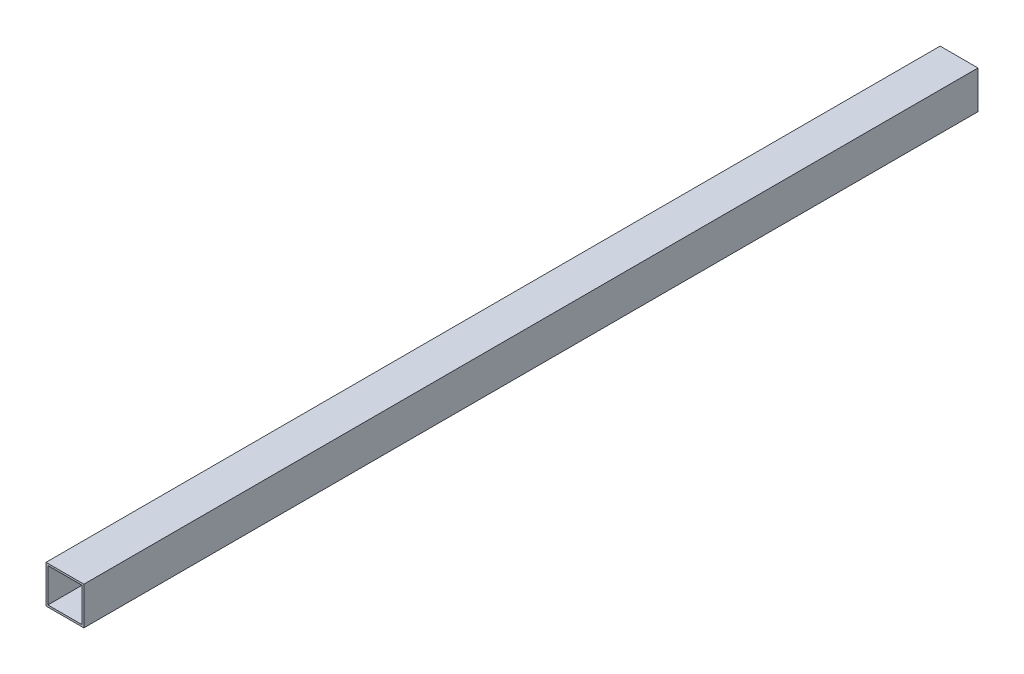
ISO-10303-21;
HEADER;
FILE_DESCRIPTION(('STEP AP214'),'2;1');
FILE_NAME('part.step','',(''),(''),'','','');
FILE_SCHEMA(('AUTOMOTIVE_DESIGN { 1 0 10303 214 1 1 1 1 }'));
ENDSEC;
DATA;
#1=APPLICATION_CONTEXT('core data for automotive mechanical design processes');
#2=APPLICATION_PROTOCOL_DEFINITION('international standard','automotive_design',2000,#1);
#3=PRODUCT_CONTEXT('',#1,'mechanical');
#4=PRODUCT('Part','Part','',(#3));
#5=PRODUCT_RELATED_PRODUCT_CATEGORY('part','',(#4));
#6=PRODUCT_DEFINITION_FORMATION('','',#4);
#7=PRODUCT_DEFINITION_CONTEXT('part definition',#1,'design');
#8=PRODUCT_DEFINITION('design','',#6,#7);
#9=PRODUCT_DEFINITION_SHAPE('','',#8);
#10=(LENGTH_UNIT() NAMED_UNIT(*) SI_UNIT(.MILLI.,.METRE.));
#11=(NAMED_UNIT(*) PLANE_ANGLE_UNIT() SI_UNIT($,.RADIAN.));
#12=(NAMED_UNIT(*) SI_UNIT($,.STERADIAN.) SOLID_ANGLE_UNIT());
#13=UNCERTAINTY_MEASURE_WITH_UNIT(LENGTH_MEASURE(1.E-05),#10,'distance_accuracy_value','');
#14=(GEOMETRIC_REPRESENTATION_CONTEXT(3) GLOBAL_UNCERTAINTY_ASSIGNED_CONTEXT((#13)) GLOBAL_UNIT_ASSIGNED_CONTEXT((#10,
#11,#12)) REPRESENTATION_CONTEXT('',''));
#15=CARTESIAN_POINT('',(0.,0.,0.));
#16=DIRECTION('',(0.,0.,1.));
#17=DIRECTION('',(1.,0.,0.));
#18=AXIS2_PLACEMENT_3D('',#15,#16,#17);
#19=CARTESIAN_POINT('',(0.,0.,1888.));
#20=DIRECTION('',(0.,0.,1.));
#21=DIRECTION('',(1.,0.,0.));
#22=AXIS2_PLACEMENT_3D('',#19,#20,#21);
#23=PLANE('',#22);
#24=DIRECTION('',(0.,-1.,0.));
#25=VECTOR('',#24,1.);
#26=CARTESIAN_POINT('',(-36.,36.,1888.));
#27=LINE('',#26,#25);
#28=CARTESIAN_POINT('',(-36.,36.,1888.));
#29=VERTEX_POINT('',#28);
#30=CARTESIAN_POINT('',(-36.,-36.,1888.));
#31=VERTEX_POINT('',#30);
#32=EDGE_CURVE('E26',#29,#31,#27,.T.);
#33=ORIENTED_EDGE('',*,*,#32,.F.);
#34=DIRECTION('',(-1.,0.,0.));
#35=VECTOR('',#34,1.);
#36=CARTESIAN_POINT('',(36.,36.,1888.));
#37=LINE('',#36,#35);
#38=CARTESIAN_POINT('',(36.,36.,1888.));
#39=VERTEX_POINT('',#38);
#40=EDGE_CURVE('E106',#39,#29,#37,.T.);
#41=ORIENTED_EDGE('',*,*,#40,.F.);
#42=DIRECTION('',(0.,1.,0.));
#43=VECTOR('',#42,1.);
#44=CARTESIAN_POINT('',(36.,-36.,1888.));
#45=LINE('',#44,#43);
#46=CARTESIAN_POINT('',(36.,-36.,1888.));
#47=VERTEX_POINT('',#46);
#48=EDGE_CURVE('E109',#47,#39,#45,.T.);
#49=ORIENTED_EDGE('',*,*,#48,.F.);
#50=DIRECTION('',(1.,0.,0.));
#51=VECTOR('',#50,1.);
#52=CARTESIAN_POINT('',(-36.,-36.,1888.));
#53=LINE('',#52,#51);
#54=EDGE_CURVE('E128',#31,#47,#53,.T.);
#55=ORIENTED_EDGE('',*,*,#54,.F.);
#56=EDGE_LOOP('',(#33,#41,#49,#55));
#57=FACE_BOUND('',#56,.T.);
#58=DIRECTION('',(1.,0.,0.));
#59=VECTOR('',#58,1.);
#60=CARTESIAN_POINT('',(-40.,-40.,1888.));
#61=LINE('',#60,#59);
#62=CARTESIAN_POINT('',(-40.,-40.,1888.));
#63=VERTEX_POINT('',#62);
#64=CARTESIAN_POINT('',(40.,-40.,1888.));
#65=VERTEX_POINT('',#64);
#66=EDGE_CURVE('E187',#63,#65,#61,.T.);
#67=ORIENTED_EDGE('',*,*,#66,.T.);
#68=DIRECTION('',(0.,1.,0.));
#69=VECTOR('',#68,1.);
#70=CARTESIAN_POINT('',(40.,-40.,1888.));
#71=LINE('',#70,#69);
#72=CARTESIAN_POINT('',(40.,40.,1888.));
#73=VERTEX_POINT('',#72);
#74=EDGE_CURVE('E209',#65,#73,#71,.T.);
#75=ORIENTED_EDGE('',*,*,#74,.T.);
#76=DIRECTION('',(-1.,0.,0.));
#77=VECTOR('',#76,1.);
#78=CARTESIAN_POINT('',(40.,40.,1888.));
#79=LINE('',#78,#77);
#80=CARTESIAN_POINT('',(-40.,40.,1888.));
#81=VERTEX_POINT('',#80);
#82=EDGE_CURVE('E179',#73,#81,#79,.T.);
#83=ORIENTED_EDGE('',*,*,#82,.T.);
#84=DIRECTION('',(0.,-1.,0.));
#85=VECTOR('',#84,1.);
#86=CARTESIAN_POINT('',(-40.,40.,1888.));
#87=LINE('',#86,#85);
#88=EDGE_CURVE('E136',#81,#63,#87,.T.);
#89=ORIENTED_EDGE('',*,*,#88,.T.);
#90=EDGE_LOOP('',(#67,#75,#83,#89));
#91=FACE_BOUND('',#90,.T.);
#92=ADVANCED_FACE('F16',(#57,#91),#23,.T.);
#93=CARTESIAN_POINT('',(0.,0.,0.));
#94=DIRECTION('',(0.,0.,1.));
#95=DIRECTION('',(1.,0.,0.));
#96=AXIS2_PLACEMENT_3D('',#93,#94,#95);
#97=PLANE('',#96);
#98=DIRECTION('',(1.,0.,0.));
#99=VECTOR('',#98,1.);
#100=CARTESIAN_POINT('',(-36.,-36.,0.));
#101=LINE('',#100,#99);
#102=CARTESIAN_POINT('',(-36.,-36.,0.));
#103=VERTEX_POINT('',#102);
#104=CARTESIAN_POINT('',(36.,-36.,0.));
#105=VERTEX_POINT('',#104);
#106=EDGE_CURVE('E101',#103,#105,#101,.T.);
#107=ORIENTED_EDGE('',*,*,#106,.T.);
#108=DIRECTION('',(0.,1.,0.));
#109=VECTOR('',#108,1.);
#110=CARTESIAN_POINT('',(36.,-36.,0.));
#111=LINE('',#110,#109);
#112=CARTESIAN_POINT('',(36.,36.,0.));
#113=VERTEX_POINT('',#112);
#114=EDGE_CURVE('E98',#105,#113,#111,.T.);
#115=ORIENTED_EDGE('',*,*,#114,.T.);
#116=DIRECTION('',(-1.,0.,0.));
#117=VECTOR('',#116,1.);
#118=CARTESIAN_POINT('',(36.,36.,0.));
#119=LINE('',#118,#117);
#120=CARTESIAN_POINT('',(-36.,36.,0.));
#121=VERTEX_POINT('',#120);
#122=EDGE_CURVE('E85',#113,#121,#119,.T.);
#123=ORIENTED_EDGE('',*,*,#122,.T.);
#124=DIRECTION('',(0.,-1.,0.));
#125=VECTOR('',#124,1.);
#126=CARTESIAN_POINT('',(-36.,36.,0.));
#127=LINE('',#126,#125);
#128=EDGE_CURVE('E10',#121,#103,#127,.T.);
#129=ORIENTED_EDGE('',*,*,#128,.T.);
#130=EDGE_LOOP('',(#107,#115,#123,#129));
#131=FACE_BOUND('',#130,.T.);
#132=DIRECTION('',(0.,-1.,0.));
#133=VECTOR('',#132,1.);
#134=CARTESIAN_POINT('',(-40.,40.,0.));
#135=LINE('',#134,#133);
#136=CARTESIAN_POINT('',(-40.,40.,0.));
#137=VERTEX_POINT('',#136);
#138=CARTESIAN_POINT('',(-40.,-40.,0.));
#139=VERTEX_POINT('',#138);
#140=EDGE_CURVE('E141',#137,#139,#135,.T.);
#141=ORIENTED_EDGE('',*,*,#140,.F.);
#142=DIRECTION('',(-1.,0.,0.));
#143=VECTOR('',#142,1.);
#144=CARTESIAN_POINT('',(40.,40.,0.));
#145=LINE('',#144,#143);
#146=CARTESIAN_POINT('',(40.,40.,0.));
#147=VERTEX_POINT('',#146);
#148=EDGE_CURVE('E198',#147,#137,#145,.T.);
#149=ORIENTED_EDGE('',*,*,#148,.F.);
#150=DIRECTION('',(0.,1.,0.));
#151=VECTOR('',#150,1.);
#152=CARTESIAN_POINT('',(40.,-40.,0.));
#153=LINE('',#152,#151);
#154=CARTESIAN_POINT('',(40.,-40.,0.));
#155=VERTEX_POINT('',#154);
#156=EDGE_CURVE('E162',#155,#147,#153,.T.);
#157=ORIENTED_EDGE('',*,*,#156,.F.);
#158=DIRECTION('',(1.,0.,0.));
#159=VECTOR('',#158,1.);
#160=CARTESIAN_POINT('',(-40.,-40.,0.));
#161=LINE('',#160,#159);
#162=EDGE_CURVE('E185',#139,#155,#161,.T.);
#163=ORIENTED_EDGE('',*,*,#162,.F.);
#164=EDGE_LOOP('',(#141,#149,#157,#163));
#165=FACE_BOUND('',#164,.T.);
#166=ADVANCED_FACE('F18',(#131,#165),#97,.F.);
#167=CARTESIAN_POINT('',(-36.,36.,0.));
#168=DIRECTION('',(1.,0.,0.));
#169=DIRECTION('',(0.,1.,0.));
#170=AXIS2_PLACEMENT_3D('',#167,#168,#169);
#171=PLANE('',#170);
#172=DIRECTION('',(0.,0.,1.));
#173=VECTOR('',#172,1.);
#174=CARTESIAN_POINT('',(-36.,36.,0.));
#175=LINE('',#174,#173);
#176=EDGE_CURVE('E92',#121,#29,#175,.T.);
#177=ORIENTED_EDGE('',*,*,#176,.T.);
#178=ORIENTED_EDGE('',*,*,#32,.T.);
#179=DIRECTION('',(0.,0.,1.));
#180=VECTOR('',#179,1.);
#181=CARTESIAN_POINT('',(-36.,-36.,0.));
#182=LINE('',#181,#180);
#183=EDGE_CURVE('E125',#103,#31,#182,.T.);
#184=ORIENTED_EDGE('',*,*,#183,.F.);
#185=ORIENTED_EDGE('',*,*,#128,.F.);
#186=EDGE_LOOP('',(#177,#178,#184,#185));
#187=FACE_BOUND('',#186,.T.);
#188=ADVANCED_FACE('F123',(#187),#171,.T.);
#189=CARTESIAN_POINT('',(36.,36.,0.));
#190=DIRECTION('',(0.,-1.,0.));
#191=DIRECTION('',(0.,0.,-1.));
#192=AXIS2_PLACEMENT_3D('',#189,#190,#191);
#193=PLANE('',#192);
#194=DIRECTION('',(0.,0.,1.));
#195=VECTOR('',#194,1.);
#196=CARTESIAN_POINT('',(36.,36.,0.));
#197=LINE('',#196,#195);
#198=EDGE_CURVE('E90',#113,#39,#197,.T.);
#199=ORIENTED_EDGE('',*,*,#198,.T.);
#200=ORIENTED_EDGE('',*,*,#40,.T.);
#201=ORIENTED_EDGE('',*,*,#176,.F.);
#202=ORIENTED_EDGE('',*,*,#122,.F.);
#203=EDGE_LOOP('',(#199,#200,#201,#202));
#204=FACE_BOUND('',#203,.T.);
#205=ADVANCED_FACE('F87',(#204),#193,.T.);
#206=CARTESIAN_POINT('',(36.,-36.,0.));
#207=DIRECTION('',(-1.,0.,0.));
#208=DIRECTION('',(0.,0.,1.));
#209=AXIS2_PLACEMENT_3D('',#206,#207,#208);
#210=PLANE('',#209);
#211=DIRECTION('',(0.,0.,1.));
#212=VECTOR('',#211,1.);
#213=CARTESIAN_POINT('',(36.,-36.,0.));
#214=LINE('',#213,#212);
#215=EDGE_CURVE('E132',#105,#47,#214,.T.);
#216=ORIENTED_EDGE('',*,*,#215,.T.);
#217=ORIENTED_EDGE('',*,*,#48,.T.);
#218=ORIENTED_EDGE('',*,*,#198,.F.);
#219=ORIENTED_EDGE('',*,*,#114,.F.);
#220=EDGE_LOOP('',(#216,#217,#218,#219));
#221=FACE_BOUND('',#220,.T.);
#222=ADVANCED_FACE('F108',(#221),#210,.T.);
#223=CARTESIAN_POINT('',(-36.,-36.,0.));
#224=DIRECTION('',(0.,1.,0.));
#225=DIRECTION('',(1.,0.,0.));
#226=AXIS2_PLACEMENT_3D('',#223,#224,#225);
#227=PLANE('',#226);
#228=ORIENTED_EDGE('',*,*,#183,.T.);
#229=ORIENTED_EDGE('',*,*,#54,.T.);
#230=ORIENTED_EDGE('',*,*,#215,.F.);
#231=ORIENTED_EDGE('',*,*,#106,.F.);
#232=EDGE_LOOP('',(#228,#229,#230,#231));
#233=FACE_BOUND('',#232,.T.);
#234=ADVANCED_FACE('F134',(#233),#227,.T.);
#235=CARTESIAN_POINT('',(-40.,40.,0.));
#236=DIRECTION('',(1.,0.,0.));
#237=DIRECTION('',(0.,1.,0.));
#238=AXIS2_PLACEMENT_3D('',#235,#236,#237);
#239=PLANE('',#238);
#240=ORIENTED_EDGE('',*,*,#140,.T.);
#241=DIRECTION('',(0.,0.,1.));
#242=VECTOR('',#241,1.);
#243=CARTESIAN_POINT('',(-40.,-40.,0.));
#244=LINE('',#243,#242);
#245=EDGE_CURVE('E173',#139,#63,#244,.T.);
#246=ORIENTED_EDGE('',*,*,#245,.T.);
#247=ORIENTED_EDGE('',*,*,#88,.F.);
#248=DIRECTION('',(0.,0.,1.));
#249=VECTOR('',#248,1.);
#250=CARTESIAN_POINT('',(-40.,40.,0.));
#251=LINE('',#250,#249);
#252=EDGE_CURVE('E176',#137,#81,#251,.T.);
#253=ORIENTED_EDGE('',*,*,#252,.F.);
#254=EDGE_LOOP('',(#240,#246,#247,#253));
#255=FACE_BOUND('',#254,.T.);
#256=ADVANCED_FACE('F172',(#255),#239,.F.);
#257=CARTESIAN_POINT('',(40.,40.,0.));
#258=DIRECTION('',(0.,-1.,0.));
#259=DIRECTION('',(0.,0.,-1.));
#260=AXIS2_PLACEMENT_3D('',#257,#258,#259);
#261=PLANE('',#260);
#262=ORIENTED_EDGE('',*,*,#148,.T.);
#263=ORIENTED_EDGE('',*,*,#252,.T.);
#264=ORIENTED_EDGE('',*,*,#82,.F.);
#265=DIRECTION('',(0.,0.,1.));
#266=VECTOR('',#265,1.);
#267=CARTESIAN_POINT('',(40.,40.,0.));
#268=LINE('',#267,#266);
#269=EDGE_CURVE('E205',#147,#73,#268,.T.);
#270=ORIENTED_EDGE('',*,*,#269,.F.);
#271=EDGE_LOOP('',(#262,#263,#264,#270));
#272=FACE_BOUND('',#271,.T.);
#273=ADVANCED_FACE('F219',(#272),#261,.F.);
#274=CARTESIAN_POINT('',(40.,-40.,0.));
#275=DIRECTION('',(-1.,0.,0.));
#276=DIRECTION('',(0.,0.,1.));
#277=AXIS2_PLACEMENT_3D('',#274,#275,#276);
#278=PLANE('',#277);
#279=ORIENTED_EDGE('',*,*,#156,.T.);
#280=ORIENTED_EDGE('',*,*,#269,.T.);
#281=ORIENTED_EDGE('',*,*,#74,.F.);
#282=DIRECTION('',(0.,0.,1.));
#283=VECTOR('',#282,1.);
#284=CARTESIAN_POINT('',(40.,-40.,0.));
#285=LINE('',#284,#283);
#286=EDGE_CURVE('E191',#155,#65,#285,.T.);
#287=ORIENTED_EDGE('',*,*,#286,.F.);
#288=EDGE_LOOP('',(#279,#280,#281,#287));
#289=FACE_BOUND('',#288,.T.);
#290=ADVANCED_FACE('F221',(#289),#278,.F.);
#291=CARTESIAN_POINT('',(-40.,-40.,0.));
#292=DIRECTION('',(0.,1.,0.));
#293=DIRECTION('',(1.,0.,0.));
#294=AXIS2_PLACEMENT_3D('',#291,#292,#293);
#295=PLANE('',#294);
#296=ORIENTED_EDGE('',*,*,#162,.T.);
#297=ORIENTED_EDGE('',*,*,#286,.T.);
#298=ORIENTED_EDGE('',*,*,#66,.F.);
#299=ORIENTED_EDGE('',*,*,#245,.F.);
#300=EDGE_LOOP('',(#296,#297,#298,#299));
#301=FACE_BOUND('',#300,.T.);
#302=ADVANCED_FACE('F183',(#301),#295,.F.);
#303=CLOSED_SHELL('',(#92,#166,#188,#205,#222,#234,#256,#273,#290,#302));
#304=MANIFOLD_SOLID_BREP('B1',#303);
#305=ADVANCED_BREP_SHAPE_REPRESENTATION('',(#18,#304),#14);
#306=SHAPE_DEFINITION_REPRESENTATION(#9,#305);
ENDSEC;
END-ISO-10303-21;
